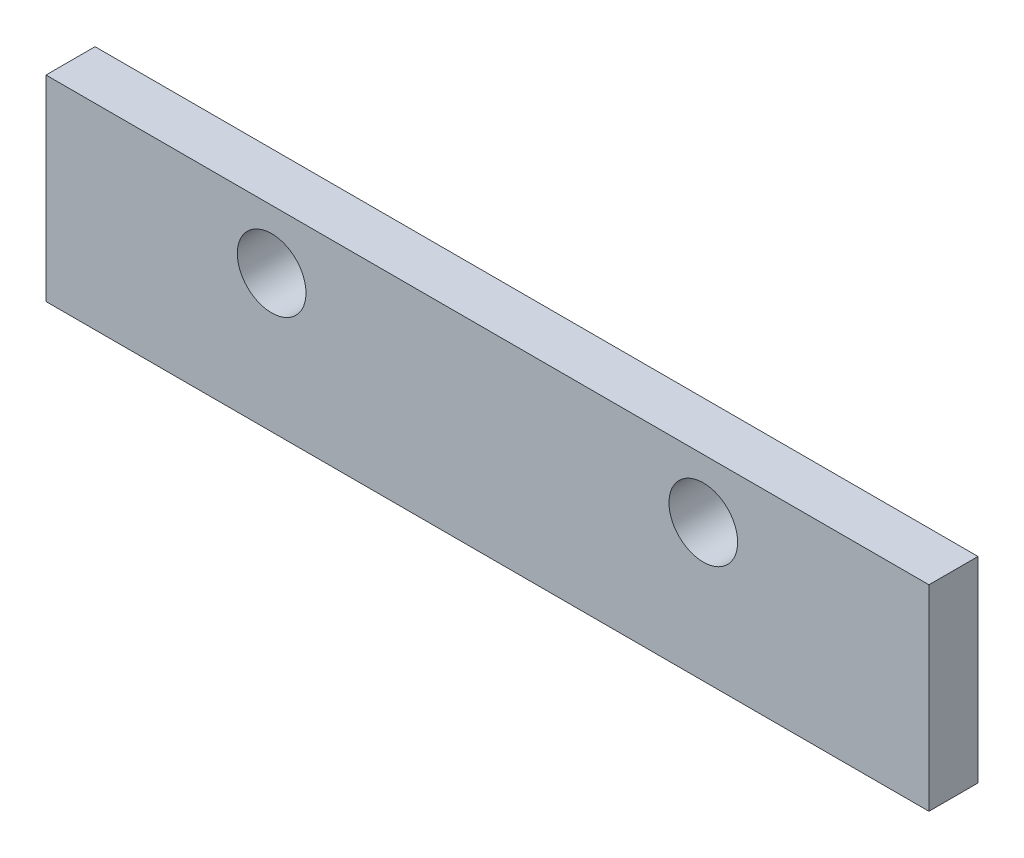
from build123d import *

# Parameters (mm, degrees)
ESQUISSE1_W      = 90
ESQUISSE1_H      = 20
ESQUISSE1_R      = 3.5
EXTRUSION1_DEPTH = 5


with BuildPart() as part:
    # Esquisse1 → Extrusion1 (new body)
    with BuildSketch(Plane.XY):
        Rectangle(ESQUISSE1_W, ESQUISSE1_H)
        with Locations((-22, 4)):
            Circle(ESQUISSE1_R, mode=Mode.SUBTRACT)
        with Locations((22, 4)):
            Circle(ESQUISSE1_R, mode=Mode.SUBTRACT)
    extrude(amount=EXTRUSION1_DEPTH)


solid = part.part
